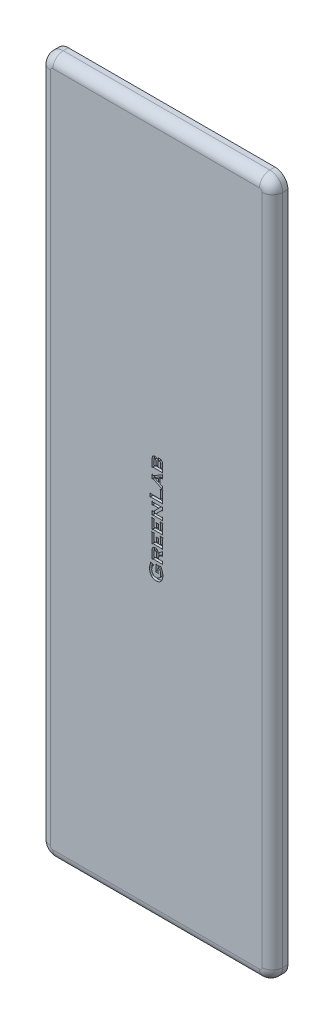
from build123d import *

# Parameters (mm, degrees)
SKETCH1_W           = 44.999999
SKETCH1_H           = 135
BOSS_EXTRUDE1_DEPTH = 3
FILLET1_R           = 2.5
FILLET2_R           = 2
CUT_EXTRUDE1_DEPTH  = 0.5


with BuildPart() as part:
    # Sketch1 → Boss-Extrude1 (new body)
    with BuildSketch(Plane.XY.offset(3)):
        with Locations((-2.56e-07, 1.025e-05)):
            Rectangle(SKETCH1_W, SKETCH1_H)
    extrude(amount=-BOSS_EXTRUDE1_DEPTH)

    # Fillet1
    fillet1_edges = [part.edges().sort_by_distance(p)[0] for p in [
        (22.499999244, 67.50001025, 1.5),
        (22.499999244, -67.49998975, 1.5),
        (-22.499999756, -67.49998975, 1.5),
        (-22.499999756, 67.50001025, 1.5),
    ]]
    fillet(fillet1_edges, radius=FILLET1_R)

    # Fillet2
    fillet2_edges = [part.edges().sort_by_distance(p)[0] for p in [
        (-22.499999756, 1.025e-05, 3),
        (-2.56e-07, 67.50001025, 3),
        (-2.56e-07, -67.49998975, 3),
        (22.499999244, 1.025e-05, 3),
        (21.767766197, 66.767777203, 3),
        (21.767766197, -66.767756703, 3),
        (-21.767766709, 66.767777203, 3),
        (-21.767766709, -66.767756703, 3),
    ]]
    fillet(fillet2_edges, radius=FILLET2_R)

    # Sketch2 → Cut-Extrude1 (cut)
    # profile 1 of 8: a face of its own
    with BuildSketch(Plane.XY.offset(3)):
        with BuildLine():
            add(Edge.make_bspline(
                [(0.149738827, 10.073794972), (0.160988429, 10.097653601), (0.182191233, 10.142621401), (0.216983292, 10.203538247), (0.251275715, 10.254872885), (0.276751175, 10.283452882), (0.288627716, 10.296776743)],
                knots=[0, 0, 0, 0, 1.199284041, 2.260363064, 3.188989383, 4, 4, 4, 4], degree=3))
            add(Edge.make_bspline(
                [(0.288627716, 10.296776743), (0.299797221, 10.307695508), (0.322147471, 10.329544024), (0.359592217, 10.357747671), (0.400282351, 10.381006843), (0.443106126, 10.400938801), (0.489354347, 10.415342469), (0.538138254, 10.426245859), (0.589916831, 10.432853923), (0.62534177, 10.433637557), (0.643445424, 10.434038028)],
                knots=[0, 0, 0, 0, 0.957204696, 1.915372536, 2.864513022, 3.827290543, 4.805779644, 5.828215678, 6.89012558, 8, 8, 8, 8], degree=3))
            add(Edge.make_bspline(
                [(0.643445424, 10.434038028), (0.667719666, 10.433495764), (0.715053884, 10.432438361), (0.784000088, 10.421773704), (0.848794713, 10.404786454), (0.909039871, 10.379804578), (0.965408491, 10.349157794), (1.016789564, 10.310335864), (1.064589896, 10.265347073), (1.091834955, 10.230432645), (1.105685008, 10.212683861)],
                knots=[0, 0, 0, 0, 1.09149512, 2.128390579, 3.131133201, 4.098244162, 5.056171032, 6.009871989, 6.988316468, 8, 8, 8, 8], degree=3))
            add(Edge.make_bspline(
                [(1.105685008, 10.212683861), (1.117268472, 10.195729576), (1.140817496, 10.16126175), (1.169713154, 10.104425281), (1.194739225, 10.043461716), (1.215471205, 9.978008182), (1.231170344, 9.907750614), (1.241450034, 9.832777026), (1.249056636, 9.753311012), (1.249679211, 9.69874247), (1.249999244, 9.670691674)],
                knots=[0, 0, 0, 0, 0.863603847, 1.755694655, 2.67743618, 3.635676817, 4.642232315, 5.703768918, 6.81962927, 8, 8, 8, 8], degree=3))
            Line((1.249999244, 9.670691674), (1.249999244, 8.246538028))
            Line((1.249999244, 8.246538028), (1.180554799, 8.246538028))
            add(Edge.make_bspline(
                [(1.180554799, 8.246538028), (1.177624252, 8.255442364), (1.172140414, 8.272104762), (1.162205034, 8.29513189), (1.148958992, 8.312960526), (1.134358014, 8.327500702), (1.116809, 8.337951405), (1.096628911, 8.345540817), (1.073124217, 8.349799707), (1.056512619, 8.350389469), (1.047633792, 8.350704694)],
                knots=[0, 0, 0, 0, 1.214308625, 2.272296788, 3.227641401, 4.072125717, 4.923398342, 5.849609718, 6.850625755, 8, 8, 8, 8], degree=3))
            Line((1.047633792, 8.350704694), (-0.596246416, 8.350704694))
            add(Edge.make_bspline(
                [(-0.596246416, 8.350704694), (-0.604925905, 8.350297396), (-0.621289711, 8.3495295), (-0.644640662, 8.34637805), (-0.664167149, 8.338329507), (-0.681548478, 8.328666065), (-0.695395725, 8.313823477), (-0.708696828, 8.295909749), (-0.719742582, 8.272723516), (-0.725892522, 8.255636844), (-0.729167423, 8.246538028)],
                knots=[0, 0, 0, 0, 1.128659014, 2.127908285, 3.03439063, 3.855433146, 4.685150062, 5.642745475, 6.744739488, 8, 8, 8, 8], degree=3))
            Line((-0.729167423, 8.246538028), (-0.798611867, 8.246538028))
            Line((-0.798611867, 8.246538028), (-0.798611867, 9.644107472))
            add(Edge.make_bspline(
                [(-0.798611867, 9.644107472), (-0.798249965, 9.673782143), (-0.797551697, 9.731037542), (-0.790687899, 9.813768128), (-0.781013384, 9.890578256), (-0.765611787, 9.961020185), (-0.746967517, 10.025643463), (-0.723377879, 10.08377924), (-0.696824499, 10.136864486), (-0.674089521, 10.167749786), (-0.662978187, 10.182844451)],
                knots=[0, 0, 0, 0, 1.259629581, 2.430375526, 3.522812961, 4.543893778, 5.488959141, 6.374407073, 7.205519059, 8, 8, 8, 8], degree=3))
            add(Edge.make_bspline(
                [(-0.662978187, 10.182844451), (-0.650840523, 10.197447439), (-0.62698792, 10.226144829), (-0.585831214, 10.263207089), (-0.541495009, 10.294417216), (-0.493942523, 10.320020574), (-0.443076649, 10.340478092), (-0.3886558, 10.354108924), (-0.331079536, 10.36333566), (-0.291561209, 10.364166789), (-0.271268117, 10.364593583)],
                knots=[0, 0, 0, 0, 1.01613969, 1.996889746, 2.956405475, 3.914354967, 4.883989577, 5.884961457, 6.913904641, 8, 8, 8, 8], degree=3))
            add(Edge.make_bspline(
                [(-0.271268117, 10.364593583), (-0.247870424, 10.364038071), (-0.202877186, 10.362969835), (-0.138992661, 10.350044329), (-0.081311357, 10.330312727), (-0.029700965, 10.30048371), (0.017373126, 10.260005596), (0.064072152, 10.209813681), (0.107837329, 10.145941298), (0.135238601, 10.098761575), (0.149738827, 10.073794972)],
                knots=[0, 0, 0, 0, 1.030716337, 1.982044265, 2.862735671, 3.709827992, 4.593441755, 5.592771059, 6.726140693, 8, 8, 8, 8], degree=3))
        make_face()
        with BuildLine():
            Line((-0.034722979, 8.836815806), (-0.034722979, 9.563812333))
            add(Edge.make_bspline(
                [(-0.034722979, 9.563812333), (-0.035158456, 9.590419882), (-0.03596374, 9.639622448), (-0.043705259, 9.707141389), (-0.056633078, 9.762352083), (-0.075538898, 9.806247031), (-0.102006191, 9.839801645), (-0.136974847, 9.862791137), (-0.179492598, 9.876576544), (-0.210392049, 9.877821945), (-0.22678027, 9.878482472)],
                knots=[0, 0, 0, 0, 1.512131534, 2.796227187, 3.855933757, 4.725485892, 5.492963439, 6.248574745, 7.071092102, 8, 8, 8, 8], degree=3))
            add(Edge.make_bspline(
                [(-0.22678027, 9.878482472), (-0.242978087, 9.87779157), (-0.273277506, 9.876499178), (-0.315348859, 9.863215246), (-0.349723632, 9.840334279), (-0.376543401, 9.807300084), (-0.395386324, 9.763476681), (-0.407524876, 9.707965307), (-0.415482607, 9.640175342), (-0.416251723, 9.590604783), (-0.416667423, 9.563812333)],
                knots=[0, 0, 0, 0, 0.921305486, 1.723381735, 2.481162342, 3.2428606, 4.114909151, 5.17520465, 6.473222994, 8, 8, 8, 8], degree=3))
            Line((-0.416667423, 9.563812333), (-0.416667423, 8.836815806))
            Line((-0.416667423, 8.836815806), (-0.034722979, 8.836815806))
        make_face(mode=Mode.SUBTRACT)
        with BuildLine():
            Line((0.868054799, 8.836815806), (0.868054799, 9.585513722))
            add(Edge.make_bspline(
                [(0.868054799, 9.585513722), (0.867566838, 9.613971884), (0.866653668, 9.667228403), (0.853834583, 9.741389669), (0.834711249, 9.805037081), (0.805587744, 9.857183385), (0.768451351, 9.898842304), (0.72174221, 9.927287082), (0.667382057, 9.945669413), (0.628236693, 9.947148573), (0.607638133, 9.947926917)],
                knots=[0, 0, 0, 0, 1.344028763, 2.515211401, 3.548364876, 4.471249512, 5.318650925, 6.156286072, 7.02982502, 8, 8, 8, 8], degree=3))
            add(Edge.make_bspline(
                [(0.607638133, 9.947926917), (0.587241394, 9.947091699), (0.54814454, 9.945490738), (0.493706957, 9.927608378), (0.447368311, 9.898444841), (0.409495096, 9.857579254), (0.381461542, 9.804710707), (0.360998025, 9.741611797), (0.349583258, 9.66711501), (0.348044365, 9.613945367), (0.347221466, 9.585513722)],
                knots=[0, 0, 0, 0, 0.962178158, 1.844321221, 2.675172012, 3.52884247, 4.448055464, 5.484422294, 6.65483368, 8, 8, 8, 8], degree=3))
            Line((0.347221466, 9.585513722), (0.347221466, 8.836815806))
            Line((0.347221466, 8.836815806), (0.868054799, 8.836815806))
        make_face(mode=Mode.SUBTRACT)
    # profile 2 of 8: a face of its own
    with BuildSketch(Plane.XY.offset(3)):
        with BuildLine():
            Line((0.72916591, 7.139767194), (0.72916591, 6.189788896))
            Line((0.72916591, 6.189788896), (0.947807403, 6.076399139))
            add(Edge.make_bspline(
                [(0.947807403, 6.076399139), (0.960193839, 6.070558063), (0.983198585, 6.059709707), (1.016501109, 6.04800744), (1.045199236, 6.039248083), (1.063318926, 6.038305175), (1.07150532, 6.037879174)],
                knots=[0, 0, 0, 0, 1.258188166, 2.336773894, 3.248561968, 4, 4, 4, 4], degree=3))
            add(Edge.make_bspline(
                [(1.07150532, 6.037879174), (1.078407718, 6.038361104), (1.091712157, 6.039290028), (1.110838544, 6.044629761), (1.127714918, 6.05491081), (1.142105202, 6.069404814), (1.155731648, 6.086881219), (1.16550433, 6.109213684), (1.174323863, 6.134779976), (1.178401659, 6.153382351), (1.180554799, 6.163204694)],
                knots=[0, 0, 0, 0, 0.910861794, 1.755694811, 2.589696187, 3.483236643, 4.43677035, 5.49240796, 6.675952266, 8, 8, 8, 8], degree=3))
            Line((1.180554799, 6.163204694), (1.249999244, 6.163204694))
            Line((1.249999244, 6.163204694), (1.249999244, 5.434038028))
            Line((1.249999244, 5.434038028), (1.180554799, 5.434038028))
            add(Edge.make_bspline(
                [(1.180554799, 5.434038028), (1.178633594, 5.44494387), (1.174964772, 5.465770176), (1.165954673, 5.494275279), (1.154371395, 5.518483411), (1.139571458, 5.539339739), (1.118918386, 5.557809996), (1.09265306, 5.577597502), (1.058217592, 5.59763754), (1.032672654, 5.61118485), (1.018879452, 5.618499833)],
                knots=[0, 0, 0, 0, 1.025916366, 1.959137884, 2.761484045, 3.50604026, 4.312579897, 5.318573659, 6.552141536, 8, 8, 8, 8], degree=3))
            Line((1.018879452, 5.618499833), (-0.467123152, 6.372623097))
            add(Edge.make_bspline(
                [(-0.467123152, 6.372623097), (-0.480593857, 6.378980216), (-0.50622389, 6.391075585), (-0.544330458, 6.405141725), (-0.580195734, 6.412946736), (-0.603269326, 6.414301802), (-0.614150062, 6.414940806)],
                knots=[0, 0, 0, 0, 1.158371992, 2.203976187, 3.153055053, 4, 4, 4, 4], degree=3))
            add(Edge.make_bspline(
                [(-0.614150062, 6.414940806), (-0.625992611, 6.413649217), (-0.650000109, 6.411030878), (-0.682843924, 6.389687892), (-0.709428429, 6.355360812), (-0.72219935, 6.327215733), (-0.729167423, 6.311859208)],
                knots=[0, 0, 0, 0, 0.861054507, 1.745550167, 2.769926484, 4, 4, 4, 4], degree=3))
            Line((-0.729167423, 6.311859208), (-0.798611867, 6.311859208))
            Line((-0.798611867, 6.311859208), (-0.798611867, 7.10938525))
            Line((-0.798611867, 7.10938525), (-0.729167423, 7.10938525))
            add(Edge.make_bspline(
                [(-0.729167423, 7.10938525), (-0.722547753, 7.094257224), (-0.710248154, 7.066148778), (-0.681154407, 7.033359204), (-0.646162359, 7.012034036), (-0.620220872, 7.009669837), (-0.60709711, 7.008473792)],
                knots=[0, 0, 0, 0, 1.167592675, 2.169431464, 3.073918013, 4, 4, 4, 4], degree=3))
            add(Edge.make_bspline(
                [(-0.60709711, 7.008473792), (-0.596554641, 7.009019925), (-0.574065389, 7.01018494), (-0.539222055, 7.019878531), (-0.500939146, 7.033858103), (-0.475307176, 7.047045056), (-0.461697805, 7.054046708)],
                knots=[0, 0, 0, 0, 0.821709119, 1.75287438, 2.806881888, 4, 4, 4, 4], degree=3))
            Line((-0.461697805, 7.054046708), (0.979274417, 7.826616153))
            add(Edge.make_bspline(
                [(0.979274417, 7.826616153), (0.997231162, 7.836644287), (1.02999865, 7.854943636), (1.073700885, 7.881094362), (1.106648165, 7.904557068), (1.131474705, 7.925301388), (1.149227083, 7.947871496), (1.162533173, 7.973725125), (1.173644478, 8.00414293), (1.178153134, 8.026366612), (1.180554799, 8.038204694)],
                knots=[0, 0, 0, 0, 1.612697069, 2.942851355, 3.989484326, 4.783110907, 5.469570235, 6.224377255, 7.054163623, 8, 8, 8, 8], degree=3))
            Line((1.180554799, 8.038204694), (1.249999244, 8.038204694))
            Line((1.249999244, 8.038204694), (1.249999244, 7.18751025))
            Line((1.249999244, 7.18751025), (1.180554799, 7.18751025))
            add(Edge.make_bspline(
                [(1.180554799, 7.18751025), (1.178788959, 7.196788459), (1.175449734, 7.21433366), (1.16729498, 7.238435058), (1.157094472, 7.258913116), (1.144305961, 7.27555833), (1.129501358, 7.2891568), (1.111856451, 7.298231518), (1.092302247, 7.304013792), (1.078601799, 7.304464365), (1.07150532, 7.30469775)],
                knots=[0, 0, 0, 0, 1.280586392, 2.42160363, 3.442514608, 4.370371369, 5.257057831, 6.146457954, 7.039913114, 8, 8, 8, 8], degree=3))
            add(Edge.make_bspline(
                [(1.07150532, 7.30469775), (1.061685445, 7.304140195), (1.040621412, 7.302944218), (1.007691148, 7.293248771), (0.971553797, 7.278687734), (0.947143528, 7.26553356), (0.934244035, 7.258582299)],
                knots=[0, 0, 0, 0, 0.804870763, 1.726480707, 2.798569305, 4, 4, 4, 4], degree=3))
            Line((0.934244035, 7.258582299), (0.72916591, 7.139767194))
        make_face()
        Polygon((0.451388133, 6.994367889), (-0.203993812, 6.655826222), (0.451388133, 6.329220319), align=None, mode=Mode.SUBTRACT)
    # profile 3 of 8: a face of its own
    with BuildSketch(Plane.XY.offset(3)):
        with BuildLine():
            Line((0.833332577, 3.697926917), (0.833332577, 5.199120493))
            add(Edge.make_bspline(
                [(0.833332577, 5.199120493), (0.832916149, 5.207796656), (0.832131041, 5.224154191), (0.829115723, 5.247378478), (0.820826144, 5.266632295), (0.811290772, 5.283863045), (0.796593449, 5.297743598), (0.77845885, 5.310446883), (0.755323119, 5.320973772), (0.73826287, 5.326776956), (0.72916591, 5.329871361)],
                knots=[0, 0, 0, 0, 1.136312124, 2.142337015, 3.032986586, 3.859596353, 4.69493934, 5.645323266, 6.744426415, 8, 8, 8, 8], degree=3))
            Line((0.72916591, 5.329871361), (0.72916591, 5.399315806))
            Line((0.72916591, 5.399315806), (1.35416591, 5.399315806))
            Line((1.35416591, 5.399315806), (1.35416591, 5.329871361))
            add(Edge.make_bspline(
                [(1.35416591, 5.329871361), (1.345044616, 5.326821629), (1.328093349, 5.321153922), (1.305255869, 5.310116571), (1.286775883, 5.297938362), (1.272105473, 5.283824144), (1.262340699, 5.266763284), (1.255012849, 5.24701379), (1.250989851, 5.223873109), (1.250339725, 5.20727215), (1.249999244, 5.198577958)],
                knots=[0, 0, 0, 0, 1.252901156, 2.328426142, 3.296223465, 4.129788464, 4.954638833, 5.834908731, 6.866106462, 8, 8, 8, 8], degree=3))
            Line((1.249999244, 5.198577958), (1.249999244, 3.038204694))
            Line((1.249999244, 3.038204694), (1.180554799, 3.038204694))
            add(Edge.make_bspline(
                [(1.180554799, 3.038204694), (1.177464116, 3.047305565), (1.171667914, 3.06437315), (1.161095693, 3.087461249), (1.148458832, 3.105849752), (1.134011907, 3.120148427), (1.116675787, 3.130031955), (1.097101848, 3.138032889), (1.073585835, 3.141227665), (1.057038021, 3.141972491), (1.048176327, 3.142371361)],
                knots=[0, 0, 0, 0, 1.245850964, 2.336443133, 3.279467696, 4.125082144, 4.945291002, 5.850852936, 6.849087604, 8, 8, 8, 8], degree=3))
            Line((1.048176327, 3.142371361), (-1.04817784, 3.142371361))
            add(Edge.make_bspline(
                [(-1.04817784, 3.142371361), (-1.057041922, 3.141980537), (-1.073594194, 3.141250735), (-1.09724934, 3.137934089), (-1.117061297, 3.130135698), (-1.134537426, 3.120302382), (-1.148431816, 3.105640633), (-1.161130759, 3.087494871), (-1.171659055, 3.064362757), (-1.177462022, 3.047301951), (-1.180556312, 3.038204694)],
                knots=[0, 0, 0, 0, 1.150172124, 2.147764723, 3.074619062, 3.894300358, 4.722641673, 5.665059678, 6.754950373, 8, 8, 8, 8], degree=3))
            Line((-1.180556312, 3.038204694), (-1.250000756, 3.038204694))
            Line((-1.250000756, 3.038204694), (-1.250000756, 3.802093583))
            Line((-1.250000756, 3.802093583), (-1.180556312, 3.802093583))
            add(Edge.make_bspline(
                [(-1.180556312, 3.802093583), (-1.177672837, 3.792983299), (-1.172322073, 3.776077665), (-1.161932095, 3.753088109), (-1.149705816, 3.734515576), (-1.134994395, 3.720036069), (-1.117298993, 3.710127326), (-1.09690178, 3.703143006), (-1.07330886, 3.698841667), (-1.056515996, 3.698243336), (-1.047635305, 3.697926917)],
                knots=[0, 0, 0, 0, 1.231701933, 2.285625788, 3.242999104, 4.084239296, 4.920290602, 5.83495028, 6.855041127, 8, 8, 8, 8], degree=3))
            Line((-1.047635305, 3.697926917), (0.833332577, 3.697926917))
        make_face()
    # profile 4 of 8: a face of its own
    with BuildSketch(Plane.XY.offset(3)):
        with BuildLine():
            Line((-0.093859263, 0.78126025), (1.046006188, 0.78126025))
            add(Edge.make_bspline(
                [(1.046006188, 0.78126025), (1.054892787, 0.781555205), (1.071518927, 0.782107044), (1.094866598, 0.786604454), (1.115309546, 0.793330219), (1.132882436, 0.804136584), (1.147817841, 0.818607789), (1.160318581, 0.837288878), (1.171848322, 0.859605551), (1.177534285, 0.876468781), (1.180554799, 0.885426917)],
                knots=[0, 0, 0, 0, 1.143670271, 2.139718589, 3.053348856, 3.900396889, 4.773630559, 5.710721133, 6.783882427, 8, 8, 8, 8], degree=3))
            Line((1.180554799, 0.885426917), (1.249999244, 0.885426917))
            Line((1.249999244, 0.885426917), (1.249999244, 0.225704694))
            Line((1.249999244, 0.225704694), (1.180554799, 0.225704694))
            add(Edge.make_bspline(
                [(1.180554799, 0.225704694), (1.177624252, 0.23460903), (1.172140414, 0.251271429), (1.162205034, 0.274298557), (1.148958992, 0.292127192), (1.134358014, 0.306667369), (1.116809, 0.317118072), (1.096628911, 0.324707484), (1.073124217, 0.328966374), (1.056512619, 0.329556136), (1.047633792, 0.329871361)],
                knots=[0, 0, 0, 0, 1.214308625, 2.272296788, 3.227641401, 4.072125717, 4.923398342, 5.849609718, 6.850625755, 8, 8, 8, 8], degree=3))
            Line((1.047633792, 0.329871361), (-0.596246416, 0.329871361))
            add(Edge.make_bspline(
                [(-0.596246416, 0.329871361), (-0.604925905, 0.329464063), (-0.621289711, 0.328696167), (-0.644640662, 0.325544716), (-0.664167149, 0.317496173), (-0.681548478, 0.307832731), (-0.695395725, 0.292990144), (-0.708696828, 0.275076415), (-0.719742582, 0.251890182), (-0.725892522, 0.23480351), (-0.729167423, 0.225704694)],
                knots=[0, 0, 0, 0, 1.128659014, 2.127908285, 3.03439063, 3.855433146, 4.685150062, 5.642745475, 6.744739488, 8, 8, 8, 8], degree=3))
            Line((-0.729167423, 0.225704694), (-0.798611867, 0.225704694))
            Line((-0.798611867, 0.225704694), (-0.798611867, 0.996646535))
            Line((-0.798611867, 0.996646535), (-0.729167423, 0.996646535))
            add(Edge.make_bspline(
                [(-0.729167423, 0.996646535), (-0.725710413, 0.984855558), (-0.719546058, 0.963830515), (-0.704196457, 0.937710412), (-0.683666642, 0.920129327), (-0.667240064, 0.918322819), (-0.659180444, 0.917436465)],
                knots=[0, 0, 0, 0, 1.287745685, 2.296239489, 3.164058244, 4, 4, 4, 4], degree=3))
            add(Edge.make_bspline(
                [(-0.659180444, 0.917436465), (-0.651665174, 0.918325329), (-0.635252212, 0.920266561), (-0.610677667, 0.93230744), (-0.584453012, 0.950477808), (-0.567814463, 0.966354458), (-0.55881152, 0.974945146)],
                knots=[0, 0, 0, 0, 0.763994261, 1.668524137, 2.738463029, 4, 4, 4, 4], degree=3))
            Line((-0.55881152, 0.974945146), (0.511066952, 2.03126025))
            Line((0.511066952, 2.03126025), (-0.596246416, 2.03126025))
            add(Edge.make_bspline(
                [(-0.596246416, 2.03126025), (-0.604922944, 2.030836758), (-0.621459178, 2.030029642), (-0.645026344, 2.027038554), (-0.664830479, 2.018755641), (-0.68255753, 2.009226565), (-0.697057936, 1.994714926), (-0.709712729, 1.976357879), (-0.720279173, 1.953259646), (-0.726076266, 1.936193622), (-0.729167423, 1.927093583)],
                knots=[0, 0, 0, 0, 1.124712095, 2.143541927, 3.046854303, 3.885165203, 4.728679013, 5.669360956, 6.757243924, 8, 8, 8, 8], degree=3))
            Line((-0.729167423, 1.927093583), (-0.798611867, 1.927093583))
            Line((-0.798611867, 1.927093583), (-0.798611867, 2.586815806))
            Line((-0.798611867, 2.586815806), (-0.729167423, 2.586815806))
            add(Edge.make_bspline(
                [(-0.729167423, 2.586815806), (-0.726120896, 2.577691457), (-0.720459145, 2.560734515), (-0.709383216, 2.537933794), (-0.697256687, 2.519228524), (-0.68251829, 2.504748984), (-0.664959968, 2.494980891), (-0.644829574, 2.487754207), (-0.62154772, 2.483621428), (-0.604942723, 2.482983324), (-0.596246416, 2.482649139)],
                knots=[0, 0, 0, 0, 1.243685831, 2.311300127, 3.271979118, 4.116123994, 4.955062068, 5.850833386, 6.874446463, 8, 8, 8, 8], degree=3))
            Line((-0.596246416, 2.482649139), (1.046006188, 2.482649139))
            add(Edge.make_bspline(
                [(1.046006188, 2.482649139), (1.054704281, 2.482980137), (1.071312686, 2.483612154), (1.094571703, 2.487785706), (1.114627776, 2.494829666), (1.131818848, 2.504923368), (1.146498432, 2.519330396), (1.159080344, 2.538016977), (1.171466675, 2.560528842), (1.177388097, 2.57765627), (1.180554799, 2.586815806)],
                knots=[0, 0, 0, 0, 1.122381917, 2.143110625, 3.036357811, 3.852834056, 4.694600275, 5.665840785, 6.751720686, 8, 8, 8, 8], degree=3))
            Line((1.180554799, 2.586815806), (1.249999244, 2.586815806))
            Line((1.249999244, 2.586815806), (1.249999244, 1.868499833))
            Line((1.249999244, 1.868499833), (1.180554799, 1.868499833))
            add(Edge.make_bspline(
                [(1.180554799, 1.868499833), (1.177587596, 1.880050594), (1.172237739, 1.900876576), (1.158684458, 1.927225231), (1.138616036, 1.944478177), (1.122782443, 1.946274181), (1.114908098, 1.947167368)],
                knots=[0, 0, 0, 0, 1.28387963, 2.314830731, 3.161933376, 4, 4, 4, 4], degree=3))
            add(Edge.make_bspline(
                [(1.114908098, 1.947167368), (1.106200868, 1.945950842), (1.087082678, 1.943279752), (1.064901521, 1.927821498), (1.044095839, 1.909173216), (1.020956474, 1.888308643), (0.991411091, 1.860358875), (0.969999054, 1.839077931), (0.958115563, 1.827267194)],
                knots=[0, 0, 0, 0, 0.778870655, 1.71014178, 2.353616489, 3.294570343, 4.498510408, 6, 6, 6, 6], degree=3))
            Line((0.958115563, 1.827267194), (-0.093859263, 0.78126025))
        make_face()
    # profile 5 of 8: a face of its own
    with BuildSketch(Plane.XY.offset(3)):
        with BuildLine():
            Line((0.41666591, -1.579850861), (0.868054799, -1.579850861))
            Line((0.868054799, -1.579850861), (0.868054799, -0.32171284))
            add(Edge.make_bspline(
                [(0.868054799, -0.32171284), (0.86766695, -0.313027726), (0.866943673, -0.296831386), (0.863600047, -0.273727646), (0.855883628, -0.254377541), (0.845640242, -0.237442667), (0.831558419, -0.223042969), (0.813136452, -0.210425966), (0.790059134, -0.199847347), (0.772989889, -0.19405213), (0.763888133, -0.190961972)],
                knots=[0, 0, 0, 0, 1.136968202, 2.120262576, 3.033418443, 3.84032541, 4.69303108, 5.643963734, 6.743701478, 8, 8, 8, 8], degree=3))
            Line((0.763888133, -0.190961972), (0.763888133, -0.121517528))
            Line((0.763888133, -0.121517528), (1.35416591, -0.121517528))
            Line((1.35416591, -0.121517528), (1.35416591, -0.190961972))
            add(Edge.make_bspline(
                [(1.35416591, -0.190961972), (1.345209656, -0.193594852), (1.328327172, -0.198557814), (1.305885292, -0.209503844), (1.287543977, -0.222103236), (1.272893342, -0.236411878), (1.261943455, -0.253605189), (1.255366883, -0.273948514), (1.250874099, -0.29710389), (1.250302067, -0.313549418), (1.249999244, -0.322255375)],
                knots=[0, 0, 0, 0, 1.21379651, 2.287998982, 3.235193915, 4.101035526, 4.937230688, 5.860712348, 6.867500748, 8, 8, 8, 8], degree=3))
            Line((1.249999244, -0.322255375), (1.249999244, -2.170128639))
            Line((1.249999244, -2.170128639), (1.180554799, -2.170128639))
            add(Edge.make_bspline(
                [(1.180554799, -2.170128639), (1.177624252, -2.161224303), (1.172140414, -2.144561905), (1.162205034, -2.121534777), (1.148958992, -2.103706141), (1.134358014, -2.089165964), (1.116809, -2.078715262), (1.096628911, -2.07112585), (1.073124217, -2.06686696), (1.056512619, -2.066277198), (1.047633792, -2.065961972)],
                knots=[0, 0, 0, 0, 1.214308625, 2.272296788, 3.227641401, 4.072125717, 4.923398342, 5.849609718, 6.850625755, 8, 8, 8, 8], degree=3))
            Line((1.047633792, -2.065961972), (-0.596246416, -2.065961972))
            add(Edge.make_bspline(
                [(-0.596246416, -2.065961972), (-0.604925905, -2.06636927), (-0.621289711, -2.067137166), (-0.644640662, -2.070288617), (-0.664167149, -2.07833716), (-0.681548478, -2.088000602), (-0.695395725, -2.10284319), (-0.708696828, -2.120756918), (-0.719742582, -2.143943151), (-0.725892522, -2.161029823), (-0.729167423, -2.170128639)],
                knots=[0, 0, 0, 0, 1.128659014, 2.127908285, 3.03439063, 3.855433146, 4.685150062, 5.642745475, 6.744739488, 8, 8, 8, 8], degree=3))
            Line((-0.729167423, -2.170128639), (-0.798611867, -2.170128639))
            Line((-0.798611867, -2.170128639), (-0.798611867, -0.392242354))
            add(Edge.make_bspline(
                [(-0.798611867, -0.392242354), (-0.799010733, -0.383380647), (-0.79975555, -0.366832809), (-0.802950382, -0.343316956), (-0.810951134, -0.323742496), (-0.820835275, -0.306408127), (-0.835131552, -0.291954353), (-0.853530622, -0.279347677), (-0.876515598, -0.268661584), (-0.893662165, -0.263271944), (-0.902778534, -0.260406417)],
                knots=[0, 0, 0, 0, 1.152027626, 2.151229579, 3.057668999, 3.878672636, 4.725106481, 5.669044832, 6.76069378, 8, 8, 8, 8], degree=3))
            Line((-0.902778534, -0.260406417), (-0.902778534, -0.190961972))
            Line((-0.902778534, -0.190961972), (-0.312500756, -0.190961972))
            Line((-0.312500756, -0.190961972), (-0.312500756, -0.260406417))
            add(Edge.make_bspline(
                [(-0.312500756, -0.260406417), (-0.321625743, -0.263259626), (-0.33878852, -0.268626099), (-0.36180292, -0.279527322), (-0.380642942, -0.291770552), (-0.394946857, -0.306436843), (-0.404860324, -0.323493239), (-0.412335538, -0.343215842), (-0.415478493, -0.3664684), (-0.416258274, -0.383016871), (-0.416667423, -0.391699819)],
                knots=[0, 0, 0, 0, 1.241043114, 2.334222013, 3.298856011, 4.146476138, 4.968630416, 5.84602308, 6.869812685, 8, 8, 8, 8], degree=3))
            Line((-0.416667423, -0.391699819), (-0.416667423, -1.579850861))
            Line((-0.416667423, -1.579850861), (0.034721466, -1.579850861))
            Line((0.034721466, -1.579850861), (0.034721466, -0.842546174))
            add(Edge.make_bspline(
                [(0.034721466, -0.842546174), (0.034316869, -0.834045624), (0.033554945, -0.818037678), (0.030377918, -0.795238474), (0.022412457, -0.77616923), (0.012317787, -0.759361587), (-0.001766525, -0.744938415), (-0.020318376, -0.732409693), (-0.043213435, -0.721161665), (-0.060330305, -0.715049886), (-0.069445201, -0.711795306)],
                knots=[0, 0, 0, 0, 1.117146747, 2.103772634, 2.997955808, 3.807596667, 4.6631914, 5.617345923, 6.731213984, 8, 8, 8, 8], degree=3))
            Line((-0.069445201, -0.711795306), (-0.069445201, -0.642350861))
            Line((-0.069445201, -0.642350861), (0.520832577, -0.642350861))
            Line((0.520832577, -0.642350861), (0.520832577, -0.711795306))
            add(Edge.make_bspline(
                [(0.520832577, -0.711795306), (0.511882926, -0.714640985), (0.495061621, -0.719989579), (0.472486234, -0.731034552), (0.453936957, -0.743152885), (0.439394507, -0.757459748), (0.428893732, -0.774180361), (0.42172705, -0.79413987), (0.417642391, -0.817242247), (0.417001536, -0.833848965), (0.41666591, -0.842546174)],
                knots=[0, 0, 0, 0, 1.225527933, 2.303439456, 3.273384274, 4.108798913, 4.947881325, 5.830104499, 6.863590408, 8, 8, 8, 8], degree=3))
            Line((0.41666591, -0.842546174), (0.41666591, -1.579850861))
        make_face()
    # profile 6 of 8: a face of its own
    with BuildSketch(Plane.XY.offset(3)):
        with BuildLine():
            Line((0.41666591, -3.975684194), (0.868054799, -3.975684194))
            Line((0.868054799, -3.975684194), (0.868054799, -2.717546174))
            add(Edge.make_bspline(
                [(0.868054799, -2.717546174), (0.86766695, -2.708861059), (0.866943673, -2.692664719), (0.863600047, -2.669560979), (0.855883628, -2.650210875), (0.845640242, -2.633276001), (0.831558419, -2.618876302), (0.813136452, -2.606259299), (0.790059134, -2.59568068), (0.772989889, -2.589885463), (0.763888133, -2.586795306)],
                knots=[0, 0, 0, 0, 1.136968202, 2.120262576, 3.033418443, 3.84032541, 4.69303108, 5.643963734, 6.743701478, 8, 8, 8, 8], degree=3))
            Line((0.763888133, -2.586795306), (0.763888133, -2.517350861))
            Line((0.763888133, -2.517350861), (1.35416591, -2.517350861))
            Line((1.35416591, -2.517350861), (1.35416591, -2.586795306))
            add(Edge.make_bspline(
                [(1.35416591, -2.586795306), (1.345209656, -2.589428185), (1.328327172, -2.594391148), (1.305885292, -2.605337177), (1.287543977, -2.61793657), (1.272893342, -2.632245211), (1.261943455, -2.649438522), (1.255366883, -2.669781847), (1.250874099, -2.692937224), (1.250302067, -2.709382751), (1.249999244, -2.718088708)],
                knots=[0, 0, 0, 0, 1.21379651, 2.287998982, 3.235193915, 4.101035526, 4.937230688, 5.860712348, 6.867500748, 8, 8, 8, 8], degree=3))
            Line((1.249999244, -2.718088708), (1.249999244, -4.565961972))
            Line((1.249999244, -4.565961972), (1.180554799, -4.565961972))
            add(Edge.make_bspline(
                [(1.180554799, -4.565961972), (1.177624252, -4.557057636), (1.172140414, -4.540395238), (1.162205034, -4.51736811), (1.148958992, -4.499539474), (1.134358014, -4.484999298), (1.116809, -4.474548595), (1.096628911, -4.466959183), (1.073124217, -4.462700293), (1.056512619, -4.462110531), (1.047633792, -4.461795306)],
                knots=[0, 0, 0, 0, 1.214308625, 2.272296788, 3.227641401, 4.072125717, 4.923398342, 5.849609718, 6.850625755, 8, 8, 8, 8], degree=3))
            Line((1.047633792, -4.461795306), (-0.596246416, -4.461795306))
            add(Edge.make_bspline(
                [(-0.596246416, -4.461795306), (-0.604925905, -4.462202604), (-0.621289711, -4.4629705), (-0.644640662, -4.46612195), (-0.664167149, -4.474170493), (-0.681548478, -4.483833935), (-0.695395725, -4.498676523), (-0.708696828, -4.516590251), (-0.719742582, -4.539776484), (-0.725892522, -4.556863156), (-0.729167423, -4.565961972)],
                knots=[0, 0, 0, 0, 1.128659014, 2.127908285, 3.03439063, 3.855433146, 4.685150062, 5.642745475, 6.744739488, 8, 8, 8, 8], degree=3))
            Line((-0.729167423, -4.565961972), (-0.798611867, -4.565961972))
            Line((-0.798611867, -4.565961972), (-0.798611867, -2.788075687))
            add(Edge.make_bspline(
                [(-0.798611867, -2.788075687), (-0.799010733, -2.77921398), (-0.79975555, -2.762666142), (-0.802950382, -2.739150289), (-0.810951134, -2.719575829), (-0.820835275, -2.70224146), (-0.835131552, -2.687787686), (-0.853530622, -2.67518101), (-0.876515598, -2.664494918), (-0.893662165, -2.659105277), (-0.902778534, -2.65623975)],
                knots=[0, 0, 0, 0, 1.152027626, 2.151229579, 3.057668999, 3.878672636, 4.725106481, 5.669044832, 6.76069378, 8, 8, 8, 8], degree=3))
            Line((-0.902778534, -2.65623975), (-0.902778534, -2.586795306))
            Line((-0.902778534, -2.586795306), (-0.312500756, -2.586795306))
            Line((-0.312500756, -2.586795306), (-0.312500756, -2.65623975))
            add(Edge.make_bspline(
                [(-0.312500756, -2.65623975), (-0.321625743, -2.65909296), (-0.33878852, -2.664459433), (-0.36180292, -2.675360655), (-0.380642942, -2.687603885), (-0.394946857, -2.702270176), (-0.404860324, -2.719326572), (-0.412335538, -2.739049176), (-0.415478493, -2.762301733), (-0.416258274, -2.778850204), (-0.416667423, -2.787533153)],
                knots=[0, 0, 0, 0, 1.241043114, 2.334222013, 3.298856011, 4.146476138, 4.968630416, 5.84602308, 6.869812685, 8, 8, 8, 8], degree=3))
            Line((-0.416667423, -2.787533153), (-0.416667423, -3.975684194))
            Line((-0.416667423, -3.975684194), (0.034721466, -3.975684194))
            Line((0.034721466, -3.975684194), (0.034721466, -3.238379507))
            add(Edge.make_bspline(
                [(0.034721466, -3.238379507), (0.034316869, -3.229878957), (0.033554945, -3.213871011), (0.030377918, -3.191071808), (0.022412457, -3.172002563), (0.012317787, -3.155194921), (-0.001766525, -3.140771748), (-0.020318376, -3.128243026), (-0.043213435, -3.116994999), (-0.060330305, -3.11088322), (-0.069445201, -3.107628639)],
                knots=[0, 0, 0, 0, 1.117146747, 2.103772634, 2.997955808, 3.807596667, 4.6631914, 5.617345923, 6.731213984, 8, 8, 8, 8], degree=3))
            Line((-0.069445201, -3.107628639), (-0.069445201, -3.038184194))
            Line((-0.069445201, -3.038184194), (0.520832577, -3.038184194))
            Line((0.520832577, -3.038184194), (0.520832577, -3.107628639))
            add(Edge.make_bspline(
                [(0.520832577, -3.107628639), (0.511882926, -3.110474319), (0.495061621, -3.115822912), (0.472486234, -3.126867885), (0.453936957, -3.138986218), (0.439394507, -3.153293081), (0.428893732, -3.170013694), (0.42172705, -3.189973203), (0.417642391, -3.213075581), (0.417001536, -3.229682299), (0.41666591, -3.238379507)],
                knots=[0, 0, 0, 0, 1.225527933, 2.303439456, 3.273384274, 4.108798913, 4.947881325, 5.830104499, 6.863590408, 8, 8, 8, 8], degree=3))
            Line((0.41666591, -3.238379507), (0.41666591, -3.975684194))
        make_face()
    # profile 7 of 8: a face of its own
    with BuildSketch(Plane.XY.offset(3)):
        with BuildLine():
            Line((0.41666591, -6.545128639), (1.048176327, -6.545128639))
            add(Edge.make_bspline(
                [(1.048176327, -6.545128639), (1.056882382, -6.544834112), (1.073150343, -6.544283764), (1.095966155, -6.539794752), (1.1156307, -6.533115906), (1.132430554, -6.522665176), (1.147026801, -6.508458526), (1.159707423, -6.489893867), (1.171326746, -6.467083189), (1.177329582, -6.450091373), (1.180554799, -6.440961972)],
                knots=[0, 0, 0, 0, 1.133233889, 2.117538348, 3.019422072, 3.823678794, 4.673583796, 5.654214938, 6.739651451, 8, 8, 8, 8], degree=3))
            Line((1.180554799, -6.440961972), (1.249999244, -6.440961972))
            Line((1.249999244, -6.440961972), (1.249999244, -7.135406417))
            Line((1.249999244, -7.135406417), (1.180554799, -7.135406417))
            add(Edge.make_bspline(
                [(1.180554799, -7.135406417), (1.177624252, -7.126502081), (1.172140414, -7.109839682), (1.162205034, -7.086812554), (1.148958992, -7.068983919), (1.134358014, -7.054443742), (1.116809, -7.04399304), (1.096628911, -7.036403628), (1.073124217, -7.032144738), (1.056512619, -7.031554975), (1.047633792, -7.03123975)],
                knots=[0, 0, 0, 0, 1.214308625, 2.272296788, 3.227641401, 4.072125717, 4.923398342, 5.849609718, 6.850625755, 8, 8, 8, 8], degree=3))
            Line((1.047633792, -7.03123975), (-0.596246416, -7.03123975))
            add(Edge.make_bspline(
                [(-0.596246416, -7.03123975), (-0.604925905, -7.031647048), (-0.621289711, -7.032414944), (-0.644640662, -7.035566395), (-0.664167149, -7.043614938), (-0.681548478, -7.05327838), (-0.695395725, -7.068120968), (-0.708696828, -7.086034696), (-0.719742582, -7.109220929), (-0.725892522, -7.126307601), (-0.729167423, -7.135406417)],
                knots=[0, 0, 0, 0, 1.128659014, 2.127908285, 3.03439063, 3.855433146, 4.685150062, 5.642745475, 6.744739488, 8, 8, 8, 8], degree=3))
            Line((-0.729167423, -7.135406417), (-0.798611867, -7.135406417))
            Line((-0.798611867, -7.135406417), (-0.798611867, -5.805111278))
            add(Edge.make_bspline(
                [(-0.798611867, -5.805111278), (-0.798346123, -5.764415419), (-0.797848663, -5.688234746), (-0.793077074, -5.581634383), (-0.785381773, -5.49051518), (-0.774083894, -5.412666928), (-0.758126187, -5.344084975), (-0.736250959, -5.281392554), (-0.709815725, -5.221906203), (-0.687609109, -5.185323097), (-0.676541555, -5.167090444)],
                knots=[0, 0, 0, 0, 1.481606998, 2.773496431, 3.884065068, 4.809673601, 5.635344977, 6.4432619, 7.224137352, 8, 8, 8, 8], degree=3))
            add(Edge.make_bspline(
                [(-0.676541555, -5.167090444), (-0.664003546, -5.14951567), (-0.639267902, -5.114843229), (-0.594041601, -5.070074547), (-0.543463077, -5.032146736), (-0.487111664, -5.000937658), (-0.424701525, -4.977314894), (-0.35705123, -4.959924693), (-0.283709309, -4.949484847), (-0.232964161, -4.948444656), (-0.206706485, -4.947906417)],
                knots=[0, 0, 0, 0, 0.954938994, 1.883953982, 2.805234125, 3.748304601, 4.727237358, 5.753162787, 6.837391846, 8, 8, 8, 8], degree=3))
            add(Edge.make_bspline(
                [(-0.206706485, -4.947906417), (-0.186615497, -4.948304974), (-0.147408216, -4.949082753), (-0.090219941, -4.955663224), (-0.036560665, -4.966558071), (0.014020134, -4.98089727), (0.060656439, -5.000825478), (0.104676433, -5.023973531), (0.144664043, -5.052380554), (0.181704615, -5.084823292), (0.215344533, -5.122224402), (0.247286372, -5.164193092), (0.275492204, -5.212008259), (0.30192888, -5.264702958), (0.325390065, -5.322713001), (0.347289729, -5.38581284), (0.366137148, -5.454389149), (0.376562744, -5.502143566), (0.381943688, -5.526790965)],
                knots=[0, 0, 0, 0, 1.054974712, 2.05876829, 3.018077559, 3.928757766, 4.81427522, 5.67693176, 6.535972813, 7.383915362, 8.257948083, 9.17356801, 10.149288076, 11.168732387, 12.267602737, 13.433048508, 14.67512408, 16, 16, 16, 16], degree=3))
            Line((0.381943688, -5.526790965), (0.917425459, -5.129655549))
            add(Edge.make_bspline(
                [(0.917425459, -5.129655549), (0.939839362, -5.112688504), (0.981291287, -5.081309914), (1.036054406, -5.035016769), (1.080188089, -4.995131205), (1.113746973, -4.958835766), (1.138892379, -4.923630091), (1.157985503, -4.887506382), (1.172471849, -4.849236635), (1.177845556, -4.822498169), (1.180554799, -4.809017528)],
                knots=[0, 0, 0, 0, 1.582811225, 2.927226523, 4.03709032, 4.931114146, 5.705394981, 6.46623019, 7.226724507, 8, 8, 8, 8], degree=3))
            Line((1.180554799, -4.809017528), (1.249999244, -4.809017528))
            Line((1.249999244, -4.809017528), (1.249999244, -5.734039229))
            Line((1.249999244, -5.734039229), (1.180554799, -5.734039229))
            add(Edge.make_bspline(
                [(1.180554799, -5.734039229), (1.176468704, -5.71930734), (1.169183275, -5.69304067), (1.151360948, -5.660879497), (1.128880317, -5.638273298), (1.110223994, -5.635889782), (1.10134473, -5.634755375)],
                knots=[0, 0, 0, 0, 1.338390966, 2.386324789, 3.231989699, 4, 4, 4, 4], degree=3))
            add(Edge.make_bspline(
                [(1.10134473, -5.634755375), (1.093818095, -5.635632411), (1.07657181, -5.637642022), (1.049722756, -5.651749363), (1.01718716, -5.670700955), (0.995155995, -5.688129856), (0.98307216, -5.697689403)],
                knots=[0, 0, 0, 0, 0.664756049, 1.523200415, 2.641504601, 4, 4, 4, 4], degree=3))
            Line((0.98307216, -5.697689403), (0.41666591, -6.106218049))
            Line((0.41666591, -6.106218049), (0.41666591, -6.545128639))
        make_face()
        with BuildLine():
            Line((0.034721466, -6.545128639), (0.034721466, -5.799685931))
            add(Edge.make_bspline(
                [(0.034721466, -5.799685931), (0.034368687, -5.773262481), (0.033710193, -5.723940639), (0.027381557, -5.655362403), (0.017079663, -5.597336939), (0.004585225, -5.563741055), (-0.001085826, -5.548492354)],
                knots=[0, 0, 0, 0, 1.241709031, 2.317766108, 3.236457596, 4, 4, 4, 4], degree=3))
            add(Edge.make_bspline(
                [(-0.001085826, -5.548492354), (-0.005349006, -5.539483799), (-0.013675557, -5.521888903), (-0.030300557, -5.498435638), (-0.049121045, -5.477802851), (-0.072151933, -5.461960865), (-0.097808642, -5.449524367), (-0.126241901, -5.440226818), (-0.157665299, -5.434719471), (-0.179556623, -5.434258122), (-0.190972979, -5.434017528)],
                knots=[0, 0, 0, 0, 1.008030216, 1.968815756, 2.902121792, 3.822384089, 4.781245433, 5.783764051, 6.844229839, 8, 8, 8, 8], degree=3))
            add(Edge.make_bspline(
                [(-0.190972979, -5.434017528), (-0.210620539, -5.43474531), (-0.24735591, -5.436106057), (-0.297846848, -5.451456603), (-0.338925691, -5.477167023), (-0.364865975, -5.507577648), (-0.379243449, -5.53722409), (-0.390082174, -5.562895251), (-0.397558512, -5.592989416), (-0.404881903, -5.626754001), (-0.410059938, -5.664489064), (-0.413660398, -5.706139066), (-0.416702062, -5.751538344), (-0.416679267, -5.783223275), (-0.416667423, -5.799685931)],
                knots=[0, 0, 0, 0, 1.425165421, 2.66465546, 3.788225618, 4.907941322, 5.513716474, 6.180377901, 6.930065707, 7.763120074, 8.692993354, 9.696653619, 10.803241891, 12, 12, 12, 12], degree=3))
            Line((-0.416667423, -5.799685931), (-0.416667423, -6.545128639))
            Line((-0.416667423, -6.545128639), (0.034721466, -6.545128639))
        make_face(mode=Mode.SUBTRACT)
    # profile 8 of 8: a face of its own
    with BuildSketch(Plane.XY.offset(3)):
        with BuildLine():
            Line((0.347221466, -8.107628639), (0.347221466, -8.736968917))
            add(Edge.make_bspline(
                [(0.347221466, -8.736968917), (0.347541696, -8.746029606), (0.348147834, -8.763179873), (0.352382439, -8.78714387), (0.359299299, -8.807604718), (0.369354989, -8.824911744), (0.383975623, -8.839074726), (0.40261786, -8.851124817), (0.42515094, -8.86294852), (0.442236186, -8.868528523), (0.451388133, -8.871517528)],
                knots=[0, 0, 0, 0, 1.162769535, 2.20091524, 3.111292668, 3.923438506, 4.744164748, 5.697055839, 6.76639631, 8, 8, 8, 8], degree=3))
            Line((0.451388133, -8.871517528), (0.451388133, -8.940961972))
            Line((0.451388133, -8.940961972), (-0.104167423, -8.940961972))
            Line((-0.104167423, -8.940961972), (-0.104167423, -8.871517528))
            add(Edge.make_bspline(
                [(-0.104167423, -8.871517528), (-0.094826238, -8.868540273), (-0.077374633, -8.862978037), (-0.054660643, -8.851109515), (-0.035489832, -8.839857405), (-0.021801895, -8.825298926), (-0.011509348, -8.808769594), (-0.004478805, -8.788823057), (-0.001124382, -8.765292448), (-0.000389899, -8.748551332), (-7.56e-07, -8.73968159)],
                knots=[0, 0, 0, 0, 1.267855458, 2.368662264, 3.318017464, 4.130433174, 4.930580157, 5.827855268, 6.849158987, 8, 8, 8, 8], degree=3))
            Line((-7.56e-07, -8.73968159), (-7.56e-07, -7.552073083))
            Line((-7.56e-07, -7.552073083), (0.069443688, -7.552073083))
            add(Edge.make_bspline(
                [(0.069443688, -7.552073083), (0.072258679, -7.561042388), (0.07754959, -7.577900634), (0.088885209, -7.6000574), (0.09962148, -7.619104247), (0.113437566, -7.633256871), (0.129271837, -7.644333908), (0.148458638, -7.650784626), (0.170314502, -7.655431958), (0.185876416, -7.655957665), (0.194226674, -7.65623975)],
                knots=[0, 0, 0, 0, 1.260451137, 2.369079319, 3.340265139, 4.182477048, 5.004819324, 5.912182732, 6.879712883, 8, 8, 8, 8], degree=3))
            Line((0.194226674, -7.65623975), (0.673827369, -7.65623975))
            add(Edge.make_bspline(
                [(0.673827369, -7.65623975), (0.682156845, -7.655870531), (0.697645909, -7.655183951), (0.719555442, -7.651644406), (0.738156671, -7.644577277), (0.754279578, -7.634459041), (0.767789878, -7.619980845), (0.77943671, -7.601236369), (0.790419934, -7.578375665), (0.795767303, -7.561203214), (0.798610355, -7.552073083)],
                knots=[0, 0, 0, 0, 1.117892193, 2.078774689, 2.961505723, 3.768722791, 4.60913424, 5.591204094, 6.719307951, 8, 8, 8, 8], degree=3))
            Line((0.798610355, -7.552073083), (0.868054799, -7.552073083))
            add(Edge.make_bspline(
                [(0.868054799, -7.552073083), (0.901305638, -7.610656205), (0.966665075, -7.725809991), (1.051147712, -7.902077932), (1.123082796, -8.07682335), (1.181932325, -8.250207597), (1.227921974, -8.422169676), (1.260407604, -8.592780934), (1.280911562, -8.762147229), (1.283456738, -8.874716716), (1.284721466, -8.930653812)],
                knots=[0, 0, 0, 0, 1.109239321, 2.180373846, 3.216973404, 4.220153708, 5.194106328, 6.146335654, 7.078892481, 8, 8, 8, 8], degree=3))
            add(Edge.make_bspline(
                [(1.284721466, -8.930653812), (1.283985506, -8.980058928), (1.282548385, -9.076533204), (1.268488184, -9.217720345), (1.246540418, -9.351914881), (1.215805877, -9.479390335), (1.17555117, -9.599945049), (1.126164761, -9.7133875), (1.068182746, -9.82024924), (1.022226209, -9.885918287), (0.999348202, -9.918609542)],
                knots=[0, 0, 0, 0, 1.132985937, 2.212402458, 3.251065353, 4.250163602, 5.21697858, 6.162602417, 7.085309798, 8, 8, 8, 8], degree=3))
            add(Edge.make_bspline(
                [(0.999348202, -9.918609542), (0.984167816, -9.938114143), (0.954033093, -9.976832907), (0.90592764, -10.031617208), (0.85502532, -10.082151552), (0.802718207, -10.129540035), (0.74740072, -10.17258314), (0.690094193, -10.211963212), (0.630939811, -10.248161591), (0.569179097, -10.279414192), (0.505623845, -10.30796823), (0.439558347, -10.332167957), (0.371388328, -10.352719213), (0.301270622, -10.370463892), (0.228692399, -10.383174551), (0.153890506, -10.392250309), (0.077150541, -10.398669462), (0.02515008, -10.399085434), (-0.001085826, -10.399295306)],
                knots=[0, 0, 0, 0, 1.027594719, 2.039887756, 3.02889878, 4.008719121, 4.97294883, 5.940778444, 6.898978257, 7.854104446, 8.816896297, 9.794723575, 10.777166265, 11.776613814, 12.800294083, 13.838400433, 14.909403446, 16, 16, 16, 16], degree=3))
            add(Edge.make_bspline(
                [(-0.001085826, -10.399295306), (-0.049624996, -10.398153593), (-0.144427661, -10.395923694), (-0.282854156, -10.375301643), (-0.413614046, -10.341711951), (-0.537142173, -10.295180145), (-0.65247147, -10.234114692), (-0.760530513, -10.160664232), (-0.860943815, -10.073185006), (-0.919975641, -10.005950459), (-0.949979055, -9.971777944)],
                knots=[0, 0, 0, 0, 1.080618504, 2.110574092, 3.109061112, 4.08310081, 5.043468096, 6.008781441, 6.987946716, 8, 8, 8, 8], degree=3))
            add(Edge.make_bspline(
                [(-0.949979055, -9.971777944), (-0.977011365, -9.937258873), (-1.03132004, -9.867909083), (-1.098570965, -9.752775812), (-1.15651679, -9.630125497), (-1.203687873, -9.498948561), (-1.239849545, -9.359417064), (-1.265689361, -9.211741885), (-1.281668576, -9.055787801), (-1.283689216, -8.948958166), (-1.284722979, -8.894303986)],
                knots=[0, 0, 0, 0, 0.913103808, 1.834451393, 2.772129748, 3.738097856, 4.735733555, 5.773315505, 6.860825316, 8, 8, 8, 8], degree=3))
            add(Edge.make_bspline(
                [(-1.284722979, -8.894303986), (-1.284113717, -8.859210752), (-1.282912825, -8.790039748), (-1.276049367, -8.687856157), (-1.263398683, -8.588828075), (-1.245835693, -8.490994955), (-1.221899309, -8.391493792), (-1.191810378, -8.286886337), (-1.154968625, -8.175971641), (-1.126398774, -8.100475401), (-1.111654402, -8.061513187)],
                knots=[0, 0, 0, 0, 0.983904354, 1.939338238, 2.869415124, 3.781350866, 4.72455948, 5.737149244, 6.832184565, 8, 8, 8, 8], degree=3))
            add(Edge.make_bspline(
                [(-1.111654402, -8.061513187), (-1.104223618, -8.042411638), (-1.090591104, -8.007367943), (-1.074748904, -7.958752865), (-1.064488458, -7.918872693), (-1.062571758, -7.894994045), (-1.061741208, -7.884646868)],
                knots=[0, 0, 0, 0, 1.33242011, 2.444457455, 3.325947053, 4, 4, 4, 4], degree=3))
            add(Edge.make_bspline(
                [(-1.061741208, -7.884646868), (-1.062380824, -7.877905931), (-1.063746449, -7.863513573), (-1.071786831, -7.841392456), (-1.086114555, -7.818580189), (-1.097772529, -7.803344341), (-1.104058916, -7.795128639)],
                knots=[0, 0, 0, 0, 0.803820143, 1.716210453, 2.768500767, 4, 4, 4, 4], degree=3))
            Line((-1.104058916, -7.795128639), (-1.076389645, -7.725684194))
            Line((-1.076389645, -7.725684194), (-0.477431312, -8.020823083))
            Line((-0.477431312, -8.020823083), (-0.505643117, -8.073991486))
            add(Edge.make_bspline(
                [(-0.505643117, -8.073991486), (-0.515250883, -8.074293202), (-0.532922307, -8.074848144), (-0.557161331, -8.079016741), (-0.577293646, -8.083473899), (-0.594499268, -8.090157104), (-0.609467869, -8.101340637), (-0.625853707, -8.115239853), (-0.642929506, -8.134653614), (-0.654546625, -8.149173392), (-0.660808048, -8.156999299)],
                knots=[0, 0, 0, 0, 1.244331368, 2.288680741, 3.181265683, 3.916936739, 4.658188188, 5.588746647, 6.700376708, 8, 8, 8, 8], degree=3))
            add(Edge.make_bspline(
                [(-0.660808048, -8.156999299), (-0.675064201, -8.177669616), (-0.705319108, -8.221536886), (-0.742719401, -8.298499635), (-0.777609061, -8.387817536), (-0.808541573, -8.487634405), (-0.834726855, -8.592106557), (-0.853751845, -8.696480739), (-0.865742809, -8.797994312), (-0.867295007, -8.864795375), (-0.868056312, -8.897559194)],
                knots=[0, 0, 0, 0, 0.772496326, 1.63941874, 2.627276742, 3.724866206, 4.855665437, 5.9428017, 6.991008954, 8, 8, 8, 8], degree=3))
            add(Edge.make_bspline(
                [(-0.868056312, -8.897559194), (-0.867507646, -8.929779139), (-0.86643507, -8.992765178), (-0.855767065, -9.085301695), (-0.838593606, -9.173489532), (-0.814662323, -9.257788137), (-0.783837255, -9.337564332), (-0.745810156, -9.413134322), (-0.701919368, -9.485130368), (-0.666555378, -9.528889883), (-0.648872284, -9.550771)],
                knots=[0, 0, 0, 0, 1.098368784, 2.14717621, 3.171603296, 4.15934231, 5.131674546, 6.083189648, 7.041535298, 8, 8, 8, 8], degree=3))
            add(Edge.make_bspline(
                [(-0.648872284, -9.550771), (-0.627889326, -9.574275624), (-0.586636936, -9.620485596), (-0.516056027, -9.679909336), (-0.441158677, -9.730550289), (-0.361167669, -9.772311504), (-0.276061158, -9.804391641), (-0.185922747, -9.82686551), (-0.091093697, -9.841690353), (-0.026100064, -9.843047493), (0.007052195, -9.84373975)],
                knots=[0, 0, 0, 0, 1.016795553, 1.999014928, 2.971244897, 3.932867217, 4.907271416, 5.901990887, 6.92983762, 8, 8, 8, 8], degree=3))
            add(Edge.make_bspline(
                [(0.007052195, -9.84373975), (0.039296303, -9.843000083), (0.102456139, -9.84155122), (0.194594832, -9.827425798), (0.282076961, -9.80553419), (0.364559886, -9.773597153), (0.442553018, -9.733404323), (0.515755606, -9.684134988), (0.584300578, -9.625904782), (0.624604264, -9.580754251), (0.645073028, -9.557823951)],
                knots=[0, 0, 0, 0, 1.069572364, 2.095080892, 3.086556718, 4.05754135, 5.024062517, 5.993022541, 6.980729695, 8, 8, 8, 8], degree=3))
            add(Edge.make_bspline(
                [(0.645073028, -9.557823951), (0.662893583, -9.535555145), (0.698691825, -9.490821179), (0.744304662, -9.417186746), (0.782096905, -9.337990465), (0.813759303, -9.254206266), (0.838244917, -9.16520874), (0.855186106, -9.070955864), (0.866595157, -8.971623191), (0.867561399, -8.903560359), (0.868054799, -8.868804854)],
                knots=[0, 0, 0, 0, 0.924808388, 1.857771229, 2.80254234, 3.768129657, 4.760342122, 5.792672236, 6.872853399, 8, 8, 8, 8], degree=3))
            add(Edge.make_bspline(
                [(0.868054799, -8.868804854), (0.867638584, -8.834239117), (0.866806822, -8.765163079), (0.856788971, -8.661985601), (0.842730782, -8.559324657), (0.821227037, -8.458583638), (0.795795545, -8.361379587), (0.765551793, -8.269893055), (0.730506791, -8.185538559), (0.702960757, -8.133125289), (0.689560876, -8.107628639)],
                knots=[0, 0, 0, 0, 1.050243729, 2.098803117, 3.148241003, 4.198254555, 5.227561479, 6.200971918, 7.124855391, 8, 8, 8, 8], degree=3))
            Line((0.689560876, -8.107628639), (0.347221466, -8.107628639))
        make_face()
    extrude(amount=-CUT_EXTRUDE1_DEPTH, mode=Mode.SUBTRACT)


solid = part.part
